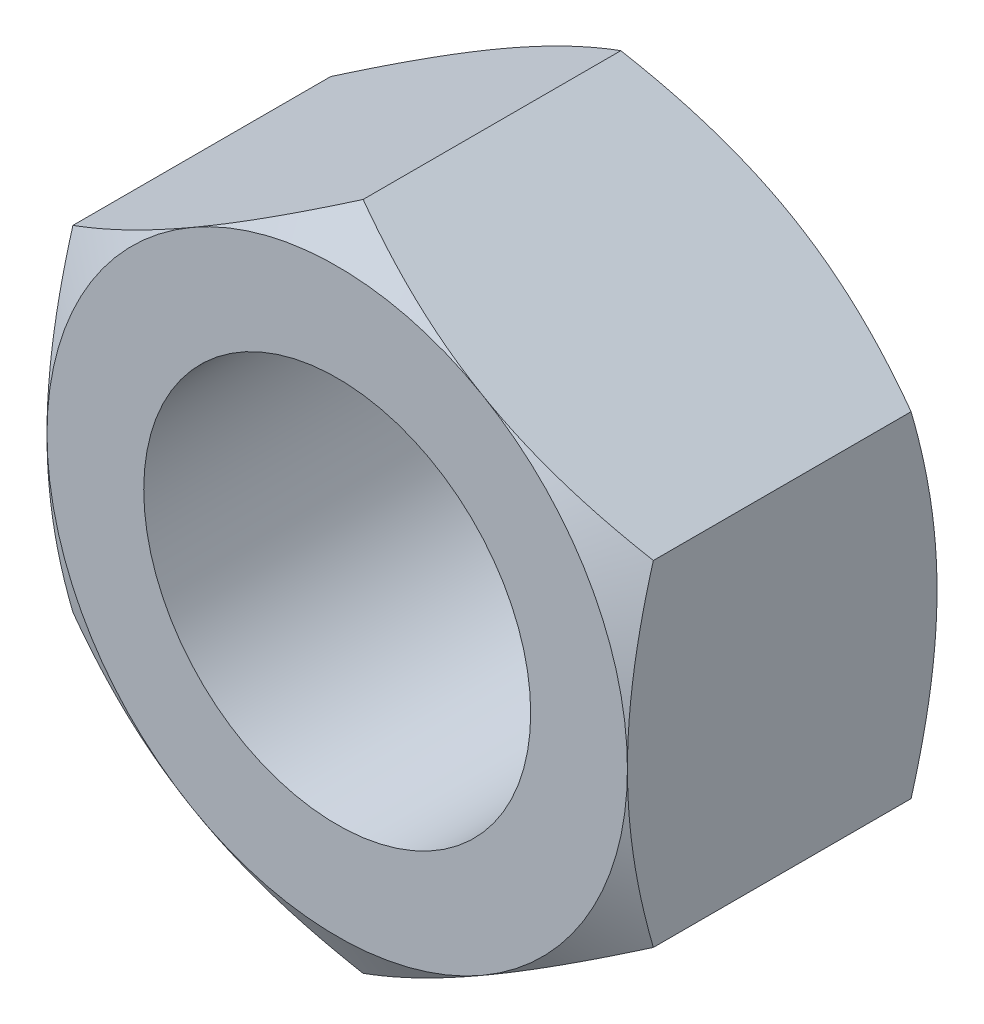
from build123d import *

# Parameters (mm, degrees)
BASE_EXTRUSION_DEPTH    = 16
ESQUISSE3_R             = 10
ENL_V_MAT_EXTRU_1_DEPTH = 28.946377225


with BuildPart() as part:
    # Esquisse1 → Base-Extrusion (new body)
    with BuildSketch(Plane.XY):
        Polygon((15, -8.660254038), (15, 8.660254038), (0, 17.320508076), (-15, 8.660254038), (-15, -8.660254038), (0, -17.320508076), align=None)
    extrude(amount=-BASE_EXTRUSION_DEPTH)

    # Esquisse2 → Enl_vement de mati_re-R_volution1 (revolve, cut)
    with BuildSketch(Plane(origin=(0, 0, 0), x_dir=(1, 0, 0), z_dir=(0, 1, 0))):
        Polygon((-15, 0), (-29.856406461, 0), (-29.856406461, 16), (-15, 16), (-28.856406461, 8), align=None)
    revolve(axis=Axis((0, 0, -16), (0, 0, 1)), mode=Mode.SUBTRACT)

    # Esquisse3 → Enl_v. mat.-Extru.1 (cut, through all)
    with BuildSketch(Plane.XY):
        Circle(ESQUISSE3_R)
    extrude(amount=-ENL_V_MAT_EXTRU_1_DEPTH, mode=Mode.SUBTRACT)


solid = part.part
